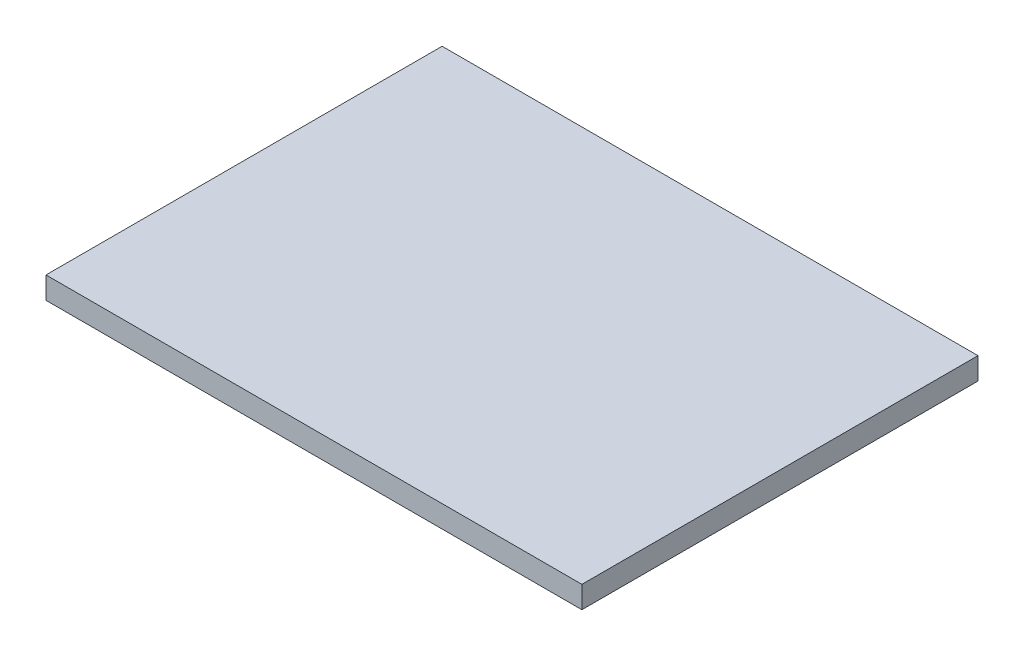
from build123d import *

# Parameters (mm, degrees)
ESQUISSE1_W        = 29.21
ESQUISSE1_H        = 21.59
BOSS_EXTRU_1_DEPTH = 1.2


with BuildPart() as part:
    # Esquisse1 → Boss.-Extru.1 (new body)
    with BuildSketch(Plane(origin=(0, 0, 0), x_dir=(1, 0, 0), z_dir=(0, 1, 0))):
        with Locations((0, 10.795)):
            Rectangle(ESQUISSE1_W, ESQUISSE1_H)
    extrude(amount=BOSS_EXTRU_1_DEPTH)


solid = part.part
